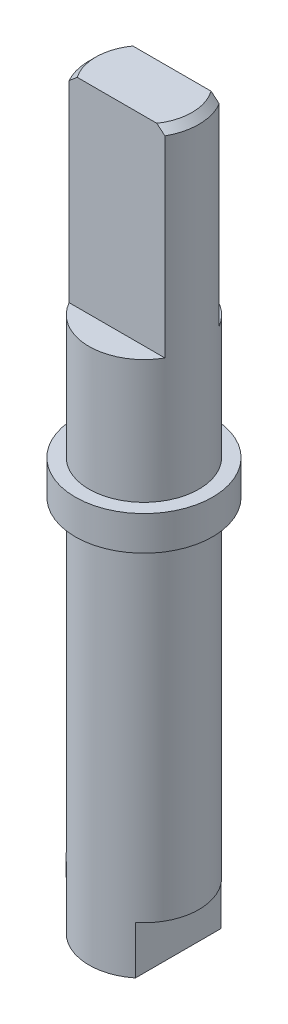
ISO-10303-21;
HEADER;
FILE_DESCRIPTION(('STEP AP214'),'2;1');
FILE_NAME('part.step','',(''),(''),'','','');
FILE_SCHEMA(('AUTOMOTIVE_DESIGN { 1 0 10303 214 1 1 1 1 }'));
ENDSEC;
DATA;
#1=APPLICATION_CONTEXT('core data for automotive mechanical design processes');
#2=APPLICATION_PROTOCOL_DEFINITION('international standard','automotive_design',2000,#1);
#3=PRODUCT_CONTEXT('',#1,'mechanical');
#4=PRODUCT('Part','Part','',(#3));
#5=PRODUCT_RELATED_PRODUCT_CATEGORY('part','',(#4));
#6=PRODUCT_DEFINITION_FORMATION('','',#4);
#7=PRODUCT_DEFINITION_CONTEXT('part definition',#1,'design');
#8=PRODUCT_DEFINITION('design','',#6,#7);
#9=PRODUCT_DEFINITION_SHAPE('','',#8);
#10=(LENGTH_UNIT() NAMED_UNIT(*) SI_UNIT(.MILLI.,.METRE.));
#11=(NAMED_UNIT(*) PLANE_ANGLE_UNIT() SI_UNIT($,.RADIAN.));
#12=(NAMED_UNIT(*) SI_UNIT($,.STERADIAN.) SOLID_ANGLE_UNIT());
#13=UNCERTAINTY_MEASURE_WITH_UNIT(LENGTH_MEASURE(1.E-05),#10,'distance_accuracy_value','');
#14=(GEOMETRIC_REPRESENTATION_CONTEXT(3) GLOBAL_UNCERTAINTY_ASSIGNED_CONTEXT((#13)) GLOBAL_UNIT_ASSIGNED_CONTEXT((#10,
#11,#12)) REPRESENTATION_CONTEXT('',''));
#15=CARTESIAN_POINT('',(0.,0.,0.));
#16=DIRECTION('',(0.,0.,1.));
#17=DIRECTION('',(1.,0.,0.));
#18=AXIS2_PLACEMENT_3D('',#15,#16,#17);
#19=CARTESIAN_POINT('',(0.,-53.5,0.));
#20=DIRECTION('',(0.,1.,0.));
#21=DIRECTION('',(0.,0.,1.));
#22=AXIS2_PLACEMENT_3D('',#19,#20,#21);
#23=PLANE('',#22);
#24=DIRECTION('',(0.,0.,-1.));
#25=VECTOR('',#24,1.);
#26=CARTESIAN_POINT('',(-5.,-53.5,14.4051103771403));
#27=LINE('',#26,#25);
#28=CARTESIAN_POINT('',(-5.,-53.5,6.2449979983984));
#29=VERTEX_POINT('',#28);
#30=CARTESIAN_POINT('',(-5.,-53.5,-6.2449979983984));
#31=VERTEX_POINT('',#30);
#32=EDGE_CURVE('E63',#29,#31,#27,.T.);
#33=ORIENTED_EDGE('',*,*,#32,.T.);
#34=CARTESIAN_POINT('',(0.,-53.5,0.));
#35=DIRECTION('',(0.,1.,0.));
#36=DIRECTION('',(0.,0.,1.));
#37=AXIS2_PLACEMENT_3D('',#34,#35,#36);
#38=CIRCLE('',#37,8.);
#39=CARTESIAN_POINT('',(5.,-53.5,-6.2449979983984));
#40=VERTEX_POINT('',#39);
#41=EDGE_CURVE('E139',#40,#31,#38,.T.);
#42=ORIENTED_EDGE('',*,*,#41,.F.);
#43=DIRECTION('',(0.,0.,1.));
#44=VECTOR('',#43,1.);
#45=CARTESIAN_POINT('',(5.,-53.5,14.4051103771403));
#46=LINE('',#45,#44);
#47=CARTESIAN_POINT('',(5.,-53.5,6.2449979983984));
#48=VERTEX_POINT('',#47);
#49=EDGE_CURVE('E71',#40,#48,#46,.T.);
#50=ORIENTED_EDGE('',*,*,#49,.T.);
#51=EDGE_CURVE('E137',#29,#48,#38,.T.);
#52=ORIENTED_EDGE('',*,*,#51,.F.);
#53=EDGE_LOOP('',(#33,#42,#50,#52));
#54=FACE_BOUND('',#53,.T.);
#55=ADVANCED_FACE('F48',(#54),#23,.F.);
#56=CARTESIAN_POINT('',(0.,53.5,0.));
#57=DIRECTION('',(0.,-1.,0.));
#58=DIRECTION('',(0.,0.,-1.));
#59=AXIS2_PLACEMENT_3D('',#56,#57,#58);
#60=CYLINDRICAL_SURFACE('',#59,8.);
#61=CARTESIAN_POINT('',(0.,1.5,0.));
#62=DIRECTION('',(0.,1.,0.));
#63=DIRECTION('',(0.,0.,1.));
#64=AXIS2_PLACEMENT_3D('',#61,#62,#63);
#65=CIRCLE('',#64,8.);
#66=CARTESIAN_POINT('',(0.,1.5,8.));
#67=VERTEX_POINT('',#66);
#68=EDGE_CURVE('E161',#67,#67,#65,.T.);
#69=ORIENTED_EDGE('',*,*,#68,.F.);
#70=EDGE_LOOP('',(#69));
#71=FACE_BOUND('',#70,.T.);
#72=DIRECTION('',(0.,-1.,0.));
#73=VECTOR('',#72,1.);
#74=CARTESIAN_POINT('',(-5.,53.5,-6.2449979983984));
#75=LINE('',#74,#73);
#76=CARTESIAN_POINT('',(-5.,-46.5,-6.2449979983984));
#77=VERTEX_POINT('',#76);
#78=EDGE_CURVE('E14',#77,#31,#75,.T.);
#79=ORIENTED_EDGE('',*,*,#78,.F.);
#80=CARTESIAN_POINT('',(0.,-46.5,0.));
#81=DIRECTION('',(0.,-1.,0.));
#82=DIRECTION('',(0.,0.,-1.));
#83=AXIS2_PLACEMENT_3D('',#80,#81,#82);
#84=CIRCLE('',#83,8.);
#85=CARTESIAN_POINT('',(-5.,-46.5,6.2449979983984));
#86=VERTEX_POINT('',#85);
#87=EDGE_CURVE('E57',#86,#77,#84,.T.);
#88=ORIENTED_EDGE('',*,*,#87,.F.);
#89=DIRECTION('',(0.,-1.,0.));
#90=VECTOR('',#89,1.);
#91=CARTESIAN_POINT('',(-5.,53.5,6.2449979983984));
#92=LINE('',#91,#90);
#93=EDGE_CURVE('E131',#29,#86,#92,.F.);
#94=ORIENTED_EDGE('',*,*,#93,.F.);
#95=ORIENTED_EDGE('',*,*,#51,.T.);
#96=DIRECTION('',(0.,-1.,0.));
#97=VECTOR('',#96,1.);
#98=CARTESIAN_POINT('',(5.,53.5,6.2449979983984));
#99=LINE('',#98,#97);
#100=CARTESIAN_POINT('',(5.,-46.5,6.2449979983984));
#101=VERTEX_POINT('',#100);
#102=EDGE_CURVE('E124',#101,#48,#99,.T.);
#103=ORIENTED_EDGE('',*,*,#102,.F.);
#104=CARTESIAN_POINT('',(5.,-46.5,-6.2449979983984));
#105=VERTEX_POINT('',#104);
#106=EDGE_CURVE('E132',#105,#101,#84,.T.);
#107=ORIENTED_EDGE('',*,*,#106,.F.);
#108=DIRECTION('',(0.,-1.,0.));
#109=VECTOR('',#108,1.);
#110=CARTESIAN_POINT('',(5.,53.5,-6.2449979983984));
#111=LINE('',#110,#109);
#112=EDGE_CURVE('E277',#40,#105,#111,.F.);
#113=ORIENTED_EDGE('',*,*,#112,.F.);
#114=ORIENTED_EDGE('',*,*,#41,.T.);
#115=EDGE_LOOP('',(#79,#88,#94,#95,#103,#107,#113,#114));
#116=FACE_BOUND('',#115,.T.);
#117=ADVANCED_FACE('F143',(#71,#116),#60,.T.);
#118=CARTESIAN_POINT('',(0.,6.5,0.));
#119=DIRECTION('',(0.,1.,0.));
#120=DIRECTION('',(0.,0.,1.));
#121=AXIS2_PLACEMENT_3D('',#118,#119,#120);
#122=CIRCLE('',#121,8.);
#123=CARTESIAN_POINT('',(0.,6.5,8.));
#124=VERTEX_POINT('',#123);
#125=EDGE_CURVE('E145',#124,#124,#122,.T.);
#126=ORIENTED_EDGE('',*,*,#125,.T.);
#127=EDGE_LOOP('',(#126));
#128=FACE_BOUND('',#127,.T.);
#129=DIRECTION('',(0.,-1.,0.));
#130=VECTOR('',#129,1.);
#131=CARTESIAN_POINT('',(6.88329001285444,53.5,-4.07680249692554));
#132=LINE('',#131,#130);
#133=CARTESIAN_POINT('',(6.88329001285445,52.5,-4.07680249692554));
#134=VERTEX_POINT('',#133);
#135=CARTESIAN_POINT('',(6.88329001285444,24.5,-4.07680249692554));
#136=VERTEX_POINT('',#135);
#137=EDGE_CURVE('E222',#134,#136,#132,.T.);
#138=ORIENTED_EDGE('',*,*,#137,.F.);
#139=CARTESIAN_POINT('',(0.,52.5,0.));
#140=DIRECTION('',(0.,1.,0.));
#141=DIRECTION('',(0.,0.,1.));
#142=AXIS2_PLACEMENT_3D('',#139,#140,#141);
#143=CIRCLE('',#142,8.);
#144=CARTESIAN_POINT('',(6.97198116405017,52.5,3.92319750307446));
#145=VERTEX_POINT('',#144);
#146=EDGE_CURVE('E158',#134,#145,#143,.F.);
#147=ORIENTED_EDGE('',*,*,#146,.T.);
#148=DIRECTION('',(0.,-1.,0.));
#149=VECTOR('',#148,1.);
#150=CARTESIAN_POINT('',(6.97198116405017,53.5,3.92319750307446));
#151=LINE('',#150,#149);
#152=CARTESIAN_POINT('',(6.97198116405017,24.5,3.92319750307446));
#153=VERTEX_POINT('',#152);
#154=EDGE_CURVE('E240',#153,#145,#151,.F.);
#155=ORIENTED_EDGE('',*,*,#154,.F.);
#156=CARTESIAN_POINT('',(0.,24.5,0.));
#157=DIRECTION('',(0.,1.,0.));
#158=DIRECTION('',(0.,0.,1.));
#159=AXIS2_PLACEMENT_3D('',#156,#157,#158);
#160=CIRCLE('',#159,8.);
#161=CARTESIAN_POINT('',(-6.97198116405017,24.5,3.92319750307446));
#162=VERTEX_POINT('',#161);
#163=EDGE_CURVE('E268',#162,#153,#160,.T.);
#164=ORIENTED_EDGE('',*,*,#163,.F.);
#165=DIRECTION('',(0.,-1.,0.));
#166=VECTOR('',#165,1.);
#167=CARTESIAN_POINT('',(-6.97198116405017,53.5,3.92319750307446));
#168=LINE('',#167,#166);
#169=CARTESIAN_POINT('',(-6.97198116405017,52.5,3.92319750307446));
#170=VERTEX_POINT('',#169);
#171=EDGE_CURVE('E254',#170,#162,#168,.T.);
#172=ORIENTED_EDGE('',*,*,#171,.F.);
#173=CARTESIAN_POINT('',(-6.88329001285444,52.5,-4.07680249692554));
#174=VERTEX_POINT('',#173);
#175=EDGE_CURVE('E159',#170,#174,#143,.F.);
#176=ORIENTED_EDGE('',*,*,#175,.T.);
#177=DIRECTION('',(0.,-1.,0.));
#178=VECTOR('',#177,1.);
#179=CARTESIAN_POINT('',(-6.88329001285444,53.5,-4.07680249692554));
#180=LINE('',#179,#178);
#181=CARTESIAN_POINT('',(-6.88329001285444,24.5,-4.07680249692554));
#182=VERTEX_POINT('',#181);
#183=EDGE_CURVE('E230',#182,#174,#180,.F.);
#184=ORIENTED_EDGE('',*,*,#183,.F.);
#185=EDGE_CURVE('E226',#136,#182,#160,.T.);
#186=ORIENTED_EDGE('',*,*,#185,.F.);
#187=EDGE_LOOP('',(#138,#147,#155,#164,#172,#176,#184,#186));
#188=FACE_BOUND('',#187,.T.);
#189=ADVANCED_FACE('F208',(#128,#188),#60,.T.);
#190=CARTESIAN_POINT('',(0.,53.5,0.));
#191=DIRECTION('',(0.,1.,0.));
#192=DIRECTION('',(0.,0.,1.));
#193=AXIS2_PLACEMENT_3D('',#190,#191,#192);
#194=PLANE('',#193);
#195=CARTESIAN_POINT('',(0.,53.5,0.));
#196=DIRECTION('',(0.,1.,0.));
#197=DIRECTION('',(0.,0.,1.));
#198=AXIS2_PLACEMENT_3D('',#195,#196,#197);
#199=CIRCLE('',#198,7.00000000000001);
#200=CARTESIAN_POINT('',(5.79728568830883,53.5,3.92319750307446));
#201=VERTEX_POINT('',#200);
#202=CARTESIAN_POINT('',(5.69031470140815,53.5,-4.07680249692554));
#203=VERTEX_POINT('',#202);
#204=EDGE_CURVE('E155',#201,#203,#199,.T.);
#205=ORIENTED_EDGE('',*,*,#204,.T.);
#206=DIRECTION('',(-1.,0.,0.));
#207=VECTOR('',#206,1.);
#208=CARTESIAN_POINT('',(-10.4524178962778,53.5,-4.07680249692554));
#209=LINE('',#208,#207);
#210=CARTESIAN_POINT('',(-5.69031470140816,53.5,-4.07680249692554));
#211=VERTEX_POINT('',#210);
#212=EDGE_CURVE('E244',#203,#211,#209,.T.);
#213=ORIENTED_EDGE('',*,*,#212,.T.);
#214=CARTESIAN_POINT('',(-5.79728568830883,53.5,3.92319750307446));
#215=VERTEX_POINT('',#214);
#216=EDGE_CURVE('E147',#211,#215,#199,.T.);
#217=ORIENTED_EDGE('',*,*,#216,.T.);
#218=DIRECTION('',(1.,0.,0.));
#219=VECTOR('',#218,1.);
#220=CARTESIAN_POINT('',(-10.4524178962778,53.5,3.92319750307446));
#221=LINE('',#220,#219);
#222=EDGE_CURVE('E237',#215,#201,#221,.T.);
#223=ORIENTED_EDGE('',*,*,#222,.T.);
#224=EDGE_LOOP('',(#205,#213,#217,#223));
#225=FACE_BOUND('',#224,.T.);
#226=ADVANCED_FACE('F205',(#225),#194,.T.);
#227=CARTESIAN_POINT('',(0.,53.5,0.));
#228=DIRECTION('',(0.,-1.,0.));
#229=DIRECTION('',(0.,0.,-1.));
#230=AXIS2_PLACEMENT_3D('',#227,#228,#229);
#231=CONICAL_SURFACE('',#230,7.00000000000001,0.785398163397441);
#232=ORIENTED_EDGE('',*,*,#146,.F.);
#233=CARTESIAN_POINT('',(17.1407828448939,42.8810682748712,-4.07680249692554));
#234=CARTESIAN_POINT('',(16.7081649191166,43.3019166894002,-4.07680249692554));
#235=CARTESIAN_POINT('',(16.2751474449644,43.7223559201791,-4.07680249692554));
#236=CARTESIAN_POINT('',(15.4080238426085,44.5621337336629,-4.07680249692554));
#237=CARTESIAN_POINT('',(14.9739176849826,44.9814722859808,-4.07680249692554));
#238=CARTESIAN_POINT('',(14.1036359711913,45.8194316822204,-4.07680249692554));
#239=CARTESIAN_POINT('',(13.6674581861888,46.238050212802,-4.07680249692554));
#240=CARTESIAN_POINT('',(12.7933325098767,47.073419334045,-4.07680249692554));
#241=CARTESIAN_POINT('',(12.3553846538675,47.4901699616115,-4.07680249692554));
#242=CARTESIAN_POINT('',(11.4477839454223,48.3489076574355,-4.07680249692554));
#243=CARTESIAN_POINT('',(10.9779669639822,48.7907214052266,-4.07680249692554));
#244=CARTESIAN_POINT('',(10.034500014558,49.6703113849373,-4.07680249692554));
#245=CARTESIAN_POINT('',(9.56084980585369,50.1080873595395,-4.07680249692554));
#246=CARTESIAN_POINT('',(8.8463945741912,50.7598950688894,-4.07680249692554));
#247=CARTESIAN_POINT('',(8.6077043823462,50.9762439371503,-4.07680249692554));
#248=CARTESIAN_POINT('',(8.12856811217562,51.4069869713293,-4.07680249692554));
#249=CARTESIAN_POINT('',(7.88812205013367,51.6213811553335,-4.07680249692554));
#250=CARTESIAN_POINT('',(7.40505100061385,52.0476518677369,-4.07680249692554));
#251=CARTESIAN_POINT('',(7.16242624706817,52.2595286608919,-4.07680249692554));
#252=CARTESIAN_POINT('',(6.67436856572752,52.6800178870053,-4.07680249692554));
#253=CARTESIAN_POINT('',(6.42893573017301,52.8886304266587,-4.07680249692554));
#254=CARTESIAN_POINT('',(6.02063791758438,53.2294722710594,-4.07680249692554));
#255=CARTESIAN_POINT('',(5.85882964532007,53.3629665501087,-4.07680249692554));
#256=CARTESIAN_POINT('',(5.53333321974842,53.6276562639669,-4.07680249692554));
#257=CARTESIAN_POINT('',(5.36964502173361,53.7588516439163,-4.07680249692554));
#258=CARTESIAN_POINT('',(5.03975753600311,54.0185564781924,-4.07680249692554));
#259=CARTESIAN_POINT('',(4.87355492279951,54.1470617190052,-4.07680249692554));
#260=CARTESIAN_POINT('',(4.53837617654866,54.400399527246,-4.07680249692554));
#261=CARTESIAN_POINT('',(4.36940017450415,54.5252322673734,-4.07680249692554));
#262=CARTESIAN_POINT('',(4.02960494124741,54.7690187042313,-4.07680249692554));
#263=CARTESIAN_POINT('',(3.8588171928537,54.8880160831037,-4.07680249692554));
#264=CARTESIAN_POINT('',(3.51305669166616,55.1199049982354,-4.07680249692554));
#265=CARTESIAN_POINT('',(3.33808293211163,55.2327950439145,-4.07680249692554));
#266=CARTESIAN_POINT('',(2.98343254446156,55.4500913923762,-4.07680249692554));
#267=CARTESIAN_POINT('',(2.80376711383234,55.5545158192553,-4.07680249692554));
#268=CARTESIAN_POINT('',(2.43839913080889,55.7521059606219,-4.07680249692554));
#269=CARTESIAN_POINT('',(2.2527006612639,55.8452790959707,-4.07680249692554));
#270=CARTESIAN_POINT('',(1.91349129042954,55.9984561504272,-4.07680249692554));
#271=CARTESIAN_POINT('',(1.76128989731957,56.0613318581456,-4.07680249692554));
#272=CARTESIAN_POINT('',(1.45224219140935,56.1746472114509,-4.07680249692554));
#273=CARTESIAN_POINT('',(1.29539585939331,56.2250868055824,-4.07680249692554));
#274=CARTESIAN_POINT('',(0.97891552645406,56.3100585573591,-4.07680249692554));
#275=CARTESIAN_POINT('',(0.81932049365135,56.3447329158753,-4.07680249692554));
#276=CARTESIAN_POINT('',(0.497249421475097,56.3960521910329,-4.07680249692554));
#277=CARTESIAN_POINT('',(0.33477491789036,56.4127064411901,-4.07680249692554));
#278=CARTESIAN_POINT('',(0.0394180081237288,56.4251618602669,-4.07680249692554));
#279=CARTESIAN_POINT('',(-0.0933311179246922,56.4242733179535,-4.07680249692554));
#280=CARTESIAN_POINT('',(-0.358105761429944,56.4096340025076,-4.07680249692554));
#281=CARTESIAN_POINT('',(-0.490131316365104,56.3958839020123,-4.07680249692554));
#282=CARTESIAN_POINT('',(-0.752997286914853,56.3562895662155,-4.07680249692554));
#283=CARTESIAN_POINT('',(-0.883828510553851,56.3303853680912,-4.07680249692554));
#284=CARTESIAN_POINT('',(-1.14289725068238,56.2678950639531,-4.07680249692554));
#285=CARTESIAN_POINT('',(-1.27113419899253,56.2313066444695,-4.07680249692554));
#286=CARTESIAN_POINT('',(-1.60252892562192,56.1238241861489,-4.07680249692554));
#287=CARTESIAN_POINT('',(-1.80332119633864,56.0456630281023,-4.07680249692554));
#288=CARTESIAN_POINT('',(-2.19731763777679,55.8721354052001,-4.07680249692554));
#289=CARTESIAN_POINT('',(-2.39051472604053,55.7767533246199,-4.07680249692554));
#290=CARTESIAN_POINT('',(-2.67565812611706,55.6242409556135,-4.07680249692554));
#291=CARTESIAN_POINT('',(-2.770117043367,55.5717143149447,-4.07680249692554));
#292=CARTESIAN_POINT('',(-2.95750969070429,55.4640003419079,-4.07680249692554));
#293=CARTESIAN_POINT('',(-3.0504434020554,55.4088129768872,-4.07680249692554));
#294=CARTESIAN_POINT('',(-3.23488056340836,55.2962090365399,-4.07680249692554));
#295=CARTESIAN_POINT('',(-3.32638471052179,55.2387935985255,-4.07680249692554));
#296=CARTESIAN_POINT('',(-3.50814381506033,55.1220309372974,-4.07680249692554));
#297=CARTESIAN_POINT('',(-3.5983988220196,55.0626837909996,-4.07680249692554));
#298=CARTESIAN_POINT('',(-3.90245718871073,54.8587126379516,-4.07680249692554));
#299=CARTESIAN_POINT('',(-4.11365066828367,54.7101936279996,-4.07680249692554));
#300=CARTESIAN_POINT('',(-4.53117345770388,54.4064457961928,-4.07680249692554));
#301=CARTESIAN_POINT('',(-4.73750169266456,54.2512155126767,-4.07680249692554));
#302=CARTESIAN_POINT('',(-5.14649613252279,53.9357174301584,-4.07680249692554));
#303=CARTESIAN_POINT('',(-5.34915958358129,53.7754460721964,-4.07680249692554));
#304=CARTESIAN_POINT('',(-5.75146645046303,53.4512038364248,-4.07680249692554));
#305=CARTESIAN_POINT('',(-5.951110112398,53.2872332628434,-4.07680249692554));
#306=CARTESIAN_POINT('',(-6.34845573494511,52.9560532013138,-4.07680249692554));
#307=CARTESIAN_POINT('',(-6.54615226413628,52.788837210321,-4.07680249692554));
#308=CARTESIAN_POINT('',(-6.93960533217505,52.4521357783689,-4.07680249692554));
#309=CARTESIAN_POINT('',(-7.13536183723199,52.2826502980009,-4.07680249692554));
#310=CARTESIAN_POINT('',(-7.72011115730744,51.771637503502,-4.07680249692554));
#311=CARTESIAN_POINT('',(-8.10674794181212,51.4274156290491,-4.07680249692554));
#312=CARTESIAN_POINT('',(-8.87615301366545,50.7337893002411,-4.07680249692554));
#313=CARTESIAN_POINT('',(-9.25891618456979,50.3843791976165,-4.07680249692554));
#314=CARTESIAN_POINT('',(-10.0213619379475,49.6821452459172,-4.07680249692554));
#315=CARTESIAN_POINT('',(-10.4010442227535,49.3293210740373,-4.07680249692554));
#316=CARTESIAN_POINT('',(-11.1576532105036,48.6216288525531,-4.07680249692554));
#317=CARTESIAN_POINT('',(-11.5345826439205,48.2667637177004,-4.07680249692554));
#318=CARTESIAN_POINT('',(-12.2866913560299,47.5551829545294,-4.07680249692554));
#319=CARTESIAN_POINT('',(-12.6618706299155,47.1984673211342,-4.07680249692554));
#320=CARTESIAN_POINT('',(-13.3806755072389,46.5124249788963,-4.07680249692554));
#321=CARTESIAN_POINT('',(-13.724406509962,46.1832086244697,-4.07680249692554));
#322=CARTESIAN_POINT('',(-14.411029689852,45.5237197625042,-4.07680249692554));
#323=CARTESIAN_POINT('',(-14.7539216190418,45.1934469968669,-4.07680249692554));
#324=CARTESIAN_POINT('',(-15.4378774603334,44.5331456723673,-4.07680249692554));
#325=CARTESIAN_POINT('',(-15.7789437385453,44.2031195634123,-4.07680249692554));
#326=CARTESIAN_POINT('',(-16.4603521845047,43.5425051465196,-4.07680249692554));
#327=CARTESIAN_POINT('',(-16.8006945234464,43.2119170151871,-4.07680249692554));
#328=CARTESIAN_POINT('',(-17.1407828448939,42.8810682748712,-4.07680249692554));
#329=B_SPLINE_CURVE_WITH_KNOTS('',3,(#233,#234,#235,#236,#237,#238,#239,#240,#241,#242,#243,
#244,#245,#246,#247,#248,#249,#250,#251,#252,#253,#254,#255,#256,#257,#258,#259,#260,#261,#262,
#263,#264,#265,#266,#267,#268,#269,#270,#271,#272,#273,#274,#275,#276,#277,#278,#279,#280,#281,
#282,#283,#284,#285,#286,#287,#288,#289,#290,#291,#292,#293,#294,#295,#296,#297,#298,#299,#300,
#301,#302,#303,#304,#305,#306,#307,#308,#309,#310,#311,#312,#313,#314,#315,#316,#317,#318,#319,
#320,#321,#322,#323,#324,#325,#326,#327,#328),.UNSPECIFIED.,.F.,.F.,(4,2,2,2,2,2,2,2,2,2,2,2,2,
2,2,2,2,2,2,2,2,2,2,2,2,2,2,2,2,2,2,2,2,2,2,2,2,2,2,2,2,2,2,2,2,2,2,4),(0.,1.81064900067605,
3.62134747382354,5.43502279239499,7.24866211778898,9.18342116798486,11.1183026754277,
12.0847410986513,13.0511705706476,14.0174974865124,14.9837927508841,15.6130806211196,
16.2423834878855,16.8726076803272,17.5028021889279,18.127170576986,18.7516906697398,
19.3748363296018,19.9975687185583,20.4911820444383,20.9847974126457,21.4738675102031,
21.9626841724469,22.3603211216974,22.7579372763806,23.1575360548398,23.557221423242,
24.2024204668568,24.8482075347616,25.1724165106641,25.4966294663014,25.820679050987,
26.1447157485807,26.919062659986,27.6935790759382,28.4686551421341,29.2436676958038,
30.0204381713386,30.7972221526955,32.3501464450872,33.9049074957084,35.4598170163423,
37.0128854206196,38.5659580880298,39.9938248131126,41.4220720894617,42.8458657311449,
44.2692735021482),.UNSPECIFIED.);
#330=EDGE_CURVE('E235',#134,#203,#329,.T.);
#331=ORIENTED_EDGE('',*,*,#330,.T.);
#332=ORIENTED_EDGE('',*,*,#204,.F.);
#333=CARTESIAN_POINT('',(-17.1765909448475,42.8810682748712,3.92319750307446));
#334=CARTESIAN_POINT('',(-16.7101786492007,43.3357339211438,3.92319750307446));
#335=CARTESIAN_POINT('',(-16.2433417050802,43.7899656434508,3.92319750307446));
#336=CARTESIAN_POINT('',(-15.3084626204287,44.697232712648,3.92319750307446));
#337=CARTESIAN_POINT('',(-14.8404204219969,45.1502679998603,3.92319750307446));
#338=CARTESIAN_POINT('',(-13.9018426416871,46.0557124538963,3.92319750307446));
#339=CARTESIAN_POINT('',(-13.4313038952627,46.508118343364,3.92319750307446));
#340=CARTESIAN_POINT('',(-12.4881968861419,47.4107731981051,3.92319750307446));
#341=CARTESIAN_POINT('',(-12.0156287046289,47.8610222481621,3.92319750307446));
#342=CARTESIAN_POINT('',(-11.042194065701,48.7826846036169,3.92319750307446));
#343=CARTESIAN_POINT('',(-10.5411722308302,49.253934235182,3.92319750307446));
#344=CARTESIAN_POINT('',(-9.78615454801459,49.9571346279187,3.92319750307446));
#345=CARTESIAN_POINT('',(-9.53388439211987,50.1909377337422,3.92319750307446));
#346=CARTESIAN_POINT('',(-9.02791078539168,50.656986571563,3.92319750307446));
#347=CARTESIAN_POINT('',(-8.77420734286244,50.8892323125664,3.92319750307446));
#348=CARTESIAN_POINT('',(-8.26528227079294,51.3515000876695,3.92319750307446));
#349=CARTESIAN_POINT('',(-8.01006258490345,51.5815242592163,3.92319750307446));
#350=CARTESIAN_POINT('',(-7.49734410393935,52.0390172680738,3.92319750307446));
#351=CARTESIAN_POINT('',(-7.2398453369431,52.2664861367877,3.92319750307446));
#352=CARTESIAN_POINT('',(-6.72193639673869,52.7179819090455,3.92319750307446));
#353=CARTESIAN_POINT('',(-6.46152683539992,52.9420095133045,3.92319750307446));
#354=CARTESIAN_POINT('',(-5.93679265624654,53.385422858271,3.92319750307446));
#355=CARTESIAN_POINT('',(-5.67246831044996,53.6048089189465,3.92319750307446));
#356=CARTESIAN_POINT('',(-5.28625364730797,53.9173634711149,3.92319750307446));
#357=CARTESIAN_POINT('',(-5.16650643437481,54.013180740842,3.92319750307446));
#358=CARTESIAN_POINT('',(-4.92576446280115,54.2032420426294,3.92319750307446));
#359=CARTESIAN_POINT('',(-4.80476968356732,54.2974860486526,3.92319750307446));
#360=CARTESIAN_POINT('',(-4.56127085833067,54.4841413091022,3.92319750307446));
#361=CARTESIAN_POINT('',(-4.4387660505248,54.5765515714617,3.92319750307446));
#362=CARTESIAN_POINT('',(-4.19206778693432,54.7590921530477,3.92319750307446));
#363=CARTESIAN_POINT('',(-4.06787435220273,54.8492225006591,3.92319750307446));
#364=CARTESIAN_POINT('',(-3.81807377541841,55.0262958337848,3.92319750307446));
#365=CARTESIAN_POINT('',(-3.69247557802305,55.1132514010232,3.92319750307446));
#366=CARTESIAN_POINT('',(-3.438984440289,55.2837472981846,3.92319750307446));
#367=CARTESIAN_POINT('',(-3.31109164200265,55.3672878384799,3.92319750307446));
#368=CARTESIAN_POINT('',(-3.0527045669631,55.5300483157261,3.92319750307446));
#369=CARTESIAN_POINT('',(-2.92221227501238,55.6092713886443,3.92319750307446));
#370=CARTESIAN_POINT('',(-2.65811689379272,55.7623337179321,3.92319750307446));
#371=CARTESIAN_POINT('',(-2.52451438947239,55.836173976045,3.92319750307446));
#372=CARTESIAN_POINT('',(-2.26633460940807,55.970457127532,3.92319750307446));
#373=CARTESIAN_POINT('',(-2.14207519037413,56.0315072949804,3.92319750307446));
#374=CARTESIAN_POINT('',(-1.89030570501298,56.1465875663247,3.92319750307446));
#375=CARTESIAN_POINT('',(-1.76279543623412,56.2006172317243,3.92319750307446));
#376=CARTESIAN_POINT('',(-1.50467482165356,56.2998371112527,3.92319750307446));
#377=CARTESIAN_POINT('',(-1.37407216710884,56.3450471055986,3.92319750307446));
#378=CARTESIAN_POINT('',(-1.10967029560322,56.4248319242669,3.92319750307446));
#379=CARTESIAN_POINT('',(-0.975872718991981,56.4594120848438,3.92319750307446));
#380=CARTESIAN_POINT('',(-0.727855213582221,56.511383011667,3.92319750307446));
#381=CARTESIAN_POINT('',(-0.614033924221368,56.5306653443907,3.92319750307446));
#382=CARTESIAN_POINT('',(-0.385169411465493,56.5595734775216,3.92319750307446));
#383=CARTESIAN_POINT('',(-0.270126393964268,56.5692008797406,3.92319750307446));
#384=CARTESIAN_POINT('',(-0.0398371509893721,56.5782841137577,3.92319750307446));
#385=CARTESIAN_POINT('',(0.0754083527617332,56.577757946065,3.92319750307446));
#386=CARTESIAN_POINT('',(0.305414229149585,56.5666109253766,3.92319750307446));
#387=CARTESIAN_POINT('',(0.42017452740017,56.5559885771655,3.92319750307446));
#388=CARTESIAN_POINT('',(0.67597984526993,56.5214657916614,3.92319750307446));
#389=CARTESIAN_POINT('',(0.816676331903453,56.4949773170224,3.92319750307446));
#390=CARTESIAN_POINT('',(1.09500069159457,56.4291064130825,3.92319750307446));
#391=CARTESIAN_POINT('',(1.23262732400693,56.3897188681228,3.92319750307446));
#392=CARTESIAN_POINT('',(1.5051231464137,56.2999747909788,3.92319750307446));
#393=CARTESIAN_POINT('',(1.6399710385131,56.249554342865,3.92319750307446));
#394=CARTESIAN_POINT('',(1.83947960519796,56.1673917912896,3.92319750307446));
#395=CARTESIAN_POINT('',(1.90551759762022,56.1389177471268,3.92319750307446));
#396=CARTESIAN_POINT('',(2.0367150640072,56.0800166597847,3.92319750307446));
#397=CARTESIAN_POINT('',(2.10187457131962,56.0495896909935,3.92319750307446));
#398=CARTESIAN_POINT('',(2.29832508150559,55.9546214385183,3.92319750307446));
#399=CARTESIAN_POINT('',(2.42829947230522,55.8873501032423,3.92319750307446));
#400=CARTESIAN_POINT('',(2.68515430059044,55.7471107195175,3.92319750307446));
#401=CARTESIAN_POINT('',(2.81203378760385,55.6741409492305,3.92319750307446));
#402=CARTESIAN_POINT('',(3.06319937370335,55.5236001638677,3.92319750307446));
#403=CARTESIAN_POINT('',(3.18748265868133,55.4460244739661,3.92319750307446));
#404=CARTESIAN_POINT('',(3.43370738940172,55.2872295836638,3.92319750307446));
#405=CARTESIAN_POINT('',(3.5556485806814,55.2060099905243,3.92319750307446));
#406=CARTESIAN_POINT('',(3.7979911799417,55.0402961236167,3.92319750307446));
#407=CARTESIAN_POINT('',(3.91838453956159,54.9557901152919,3.92319750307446));
#408=CARTESIAN_POINT('',(4.15742660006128,54.7843413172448,3.92319750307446));
#409=CARTESIAN_POINT('',(4.27607521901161,54.6973984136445,3.92319750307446));
#410=CARTESIAN_POINT('',(4.62963280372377,54.4336803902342,3.92319750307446));
#411=CARTESIAN_POINT('',(4.86230679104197,54.2539095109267,3.92319750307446));
#412=CARTESIAN_POINT('',(5.32631896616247,53.8863079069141,3.92319750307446));
#413=CARTESIAN_POINT('',(5.55759627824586,53.698400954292,3.92319750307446));
#414=CARTESIAN_POINT('',(6.01670754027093,53.3183796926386,3.92319750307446));
#415=CARTESIAN_POINT('',(6.24454105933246,53.1262648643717,3.92319750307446));
#416=CARTESIAN_POINT('',(6.69694548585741,52.7394036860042,3.92319750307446));
#417=CARTESIAN_POINT('',(6.92152325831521,52.5446653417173,3.92319750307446));
#418=CARTESIAN_POINT('',(7.3685792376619,52.1527905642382,3.92319750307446));
#419=CARTESIAN_POINT('',(7.59105741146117,51.9556540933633,3.92319750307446));
#420=CARTESIAN_POINT('',(8.22246741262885,51.3914094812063,3.92319750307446));
#421=CARTESIAN_POINT('',(8.62938514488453,51.0220491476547,3.92319750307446));
#422=CARTESIAN_POINT('',(9.43934572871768,50.2790942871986,3.92319750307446));
#423=CARTESIAN_POINT('',(9.84238845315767,49.9054996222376,3.92319750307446));
#424=CARTESIAN_POINT('',(10.646101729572,49.1549437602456,3.92319750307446));
#425=CARTESIAN_POINT('',(11.0467694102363,48.7779794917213,3.92319750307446));
#426=CARTESIAN_POINT('',(11.8460473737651,48.0218763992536,3.92319750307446));
#427=CARTESIAN_POINT('',(12.2446576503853,47.6427375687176,3.92319750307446));
#428=CARTESIAN_POINT('',(13.0226985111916,46.8996515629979,3.92319750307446));
#429=CARTESIAN_POINT('',(13.4021967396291,46.5357751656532,3.92319750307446));
#430=CARTESIAN_POINT('',(14.1600749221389,45.8068569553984,3.92319750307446));
#431=CARTESIAN_POINT('',(14.5384548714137,45.4418151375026,3.92319750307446));
#432=CARTESIAN_POINT('',(15.2938736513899,44.711244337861,3.92319750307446));
#433=CARTESIAN_POINT('',(15.670913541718,44.3457164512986,3.92319750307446));
#434=CARTESIAN_POINT('',(16.4242608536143,43.6139122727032,3.92319750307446));
#435=CARTESIAN_POINT('',(16.8005682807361,43.2476359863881,3.92319750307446));
#436=CARTESIAN_POINT('',(17.1765909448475,42.8810682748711,3.92319750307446));
#437=B_SPLINE_CURVE_WITH_KNOTS('',3,(#333,#334,#335,#336,#337,#338,#339,#340,#341,#342,#343,
#344,#345,#346,#347,#348,#349,#350,#351,#352,#353,#354,#355,#356,#357,#358,#359,#360,#361,#362,
#363,#364,#365,#366,#367,#368,#369,#370,#371,#372,#373,#374,#375,#376,#377,#378,#379,#380,#381,
#382,#383,#384,#385,#386,#387,#388,#389,#390,#391,#392,#393,#394,#395,#396,#397,#398,#399,#400,
#401,#402,#403,#404,#405,#406,#407,#408,#409,#410,#411,#412,#413,#414,#415,#416,#417,#418,#419,
#420,#421,#422,#423,#424,#425,#426,#427,#428,#429,#430,#431,#432,#433,#434,#435,#436),
.UNSPECIFIED.,.F.,.F.,(4,2,2,2,2,2,2,2,2,2,2,2,2,2,2,2,2,2,2,2,2,2,2,2,2,2,2,2,2,2,2,2,2,2,2,2,
2,2,2,2,2,2,2,2,2,2,2,2,2,2,2,4),(0.,1.95406171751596,3.90821912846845,5.86645285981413,
7.82460897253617,9.88804867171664,10.9199048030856,11.951754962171,12.9824866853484,
14.0132057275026,15.0437120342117,16.0741470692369,16.534227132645,16.9943148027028,
17.454644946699,17.9149693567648,18.3732099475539,18.8314222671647,19.2892972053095,
19.7470867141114,20.1622533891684,20.5774459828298,20.9916964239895,21.4057385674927,
21.7516950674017,22.0975941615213,22.4428800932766,22.7882171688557,23.2169912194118,
23.6459355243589,24.0774338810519,24.2931542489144,24.5088664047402,24.947722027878,
25.3867107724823,25.8261529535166,26.2656426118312,26.7068794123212,27.1481368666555,
28.0300922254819,28.9240045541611,29.8180278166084,30.7097598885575,31.6015059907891,
33.2501149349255,34.8987777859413,36.5491389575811,38.1995051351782,39.7767859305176,
41.3540734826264,42.9294857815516,44.5048860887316),.UNSPECIFIED.);
#438=EDGE_CURVE('E165',#201,#145,#437,.T.);
#439=ORIENTED_EDGE('',*,*,#438,.T.);
#440=EDGE_LOOP('',(#232,#331,#332,#439));
#441=FACE_BOUND('',#440,.T.);
#442=ADVANCED_FACE('F50',(#441),#231,.T.);
#443=ORIENTED_EDGE('',*,*,#216,.F.);
#444=EDGE_CURVE('E173',#211,#174,#329,.T.);
#445=ORIENTED_EDGE('',*,*,#444,.T.);
#446=ORIENTED_EDGE('',*,*,#175,.F.);
#447=EDGE_CURVE('E172',#170,#215,#437,.T.);
#448=ORIENTED_EDGE('',*,*,#447,.T.);
#449=EDGE_LOOP('',(#443,#445,#446,#448));
#450=FACE_BOUND('',#449,.T.);
#451=ADVANCED_FACE('F203',(#450),#231,.T.);
#452=CARTESIAN_POINT('',(0.,1.5,0.));
#453=DIRECTION('',(0.,1.,0.));
#454=DIRECTION('',(0.,0.,1.));
#455=AXIS2_PLACEMENT_3D('',#452,#453,#454);
#456=CYLINDRICAL_SURFACE('',#455,10.);
#457=CARTESIAN_POINT('',(0.,1.5,0.));
#458=DIRECTION('',(0.,1.,0.));
#459=DIRECTION('',(0.,0.,1.));
#460=AXIS2_PLACEMENT_3D('',#457,#458,#459);
#461=CIRCLE('',#460,10.);
#462=CARTESIAN_POINT('',(0.,1.5,10.));
#463=VERTEX_POINT('',#462);
#464=EDGE_CURVE('E149',#463,#463,#461,.T.);
#465=ORIENTED_EDGE('',*,*,#464,.T.);
#466=EDGE_LOOP('',(#465));
#467=FACE_BOUND('',#466,.T.);
#468=CARTESIAN_POINT('',(0.,6.5,0.));
#469=DIRECTION('',(0.,1.,0.));
#470=DIRECTION('',(0.,0.,1.));
#471=AXIS2_PLACEMENT_3D('',#468,#469,#470);
#472=CIRCLE('',#471,10.);
#473=CARTESIAN_POINT('',(0.,6.5,10.));
#474=VERTEX_POINT('',#473);
#475=EDGE_CURVE('E153',#474,#474,#472,.T.);
#476=ORIENTED_EDGE('',*,*,#475,.F.);
#477=EDGE_LOOP('',(#476));
#478=FACE_BOUND('',#477,.T.);
#479=ADVANCED_FACE('F196',(#467,#478),#456,.T.);
#480=CARTESIAN_POINT('',(0.,1.5,0.));
#481=DIRECTION('',(0.,1.,0.));
#482=DIRECTION('',(0.,0.,1.));
#483=AXIS2_PLACEMENT_3D('',#480,#481,#482);
#484=PLANE('',#483);
#485=ORIENTED_EDGE('',*,*,#68,.T.);
#486=EDGE_LOOP('',(#485));
#487=FACE_BOUND('',#486,.T.);
#488=ORIENTED_EDGE('',*,*,#464,.F.);
#489=EDGE_LOOP('',(#488));
#490=FACE_BOUND('',#489,.T.);
#491=ADVANCED_FACE('F193',(#487,#490),#484,.F.);
#492=CARTESIAN_POINT('',(0.,6.5,0.));
#493=DIRECTION('',(0.,1.,0.));
#494=DIRECTION('',(0.,0.,1.));
#495=AXIS2_PLACEMENT_3D('',#492,#493,#494);
#496=PLANE('',#495);
#497=ORIENTED_EDGE('',*,*,#125,.F.);
#498=EDGE_LOOP('',(#497));
#499=FACE_BOUND('',#498,.T.);
#500=ORIENTED_EDGE('',*,*,#475,.T.);
#501=EDGE_LOOP('',(#500));
#502=FACE_BOUND('',#501,.T.);
#503=ADVANCED_FACE('F184',(#499,#502),#496,.T.);
#504=CARTESIAN_POINT('',(-10.4524178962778,24.5,3.92319750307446));
#505=DIRECTION('',(0.,0.,1.));
#506=DIRECTION('',(1.,0.,0.));
#507=AXIS2_PLACEMENT_3D('',#504,#505,#506);
#508=PLANE('',#507);
#509=ORIENTED_EDGE('',*,*,#171,.T.);
#510=DIRECTION('',(1.,0.,0.));
#511=VECTOR('',#510,1.);
#512=CARTESIAN_POINT('',(-10.4524178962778,24.5,3.92319750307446));
#513=LINE('',#512,#511);
#514=EDGE_CURVE('E246',#162,#153,#513,.T.);
#515=ORIENTED_EDGE('',*,*,#514,.T.);
#516=ORIENTED_EDGE('',*,*,#154,.T.);
#517=ORIENTED_EDGE('',*,*,#438,.F.);
#518=ORIENTED_EDGE('',*,*,#222,.F.);
#519=ORIENTED_EDGE('',*,*,#447,.F.);
#520=EDGE_LOOP('',(#509,#515,#516,#517,#518,#519));
#521=FACE_BOUND('',#520,.T.);
#522=ADVANCED_FACE('F179',(#521),#508,.T.);
#523=CARTESIAN_POINT('',(0.204621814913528,24.5,0.));
#524=DIRECTION('',(0.,1.,0.));
#525=DIRECTION('',(0.,0.,1.));
#526=AXIS2_PLACEMENT_3D('',#523,#524,#525);
#527=PLANE('',#526);
#528=ORIENTED_EDGE('',*,*,#163,.T.);
#529=ORIENTED_EDGE('',*,*,#514,.F.);
#530=EDGE_LOOP('',(#528,#529));
#531=FACE_BOUND('',#530,.T.);
#532=ADVANCED_FACE('F183',(#531),#527,.T.);
#533=ORIENTED_EDGE('',*,*,#185,.T.);
#534=DIRECTION('',(-1.,0.,0.));
#535=VECTOR('',#534,1.);
#536=CARTESIAN_POINT('',(-10.4524178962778,24.5,-4.07680249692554));
#537=LINE('',#536,#535);
#538=EDGE_CURVE('E250',#136,#182,#537,.T.);
#539=ORIENTED_EDGE('',*,*,#538,.F.);
#540=EDGE_LOOP('',(#533,#539));
#541=FACE_BOUND('',#540,.T.);
#542=ADVANCED_FACE('F189',(#541),#527,.T.);
#543=CARTESIAN_POINT('',(-10.4524178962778,24.5,-4.07680249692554));
#544=DIRECTION('',(0.,0.,-1.));
#545=DIRECTION('',(-1.,0.,0.));
#546=AXIS2_PLACEMENT_3D('',#543,#544,#545);
#547=PLANE('',#546);
#548=ORIENTED_EDGE('',*,*,#137,.T.);
#549=ORIENTED_EDGE('',*,*,#538,.T.);
#550=ORIENTED_EDGE('',*,*,#183,.T.);
#551=ORIENTED_EDGE('',*,*,#444,.F.);
#552=ORIENTED_EDGE('',*,*,#212,.F.);
#553=ORIENTED_EDGE('',*,*,#330,.F.);
#554=EDGE_LOOP('',(#548,#549,#550,#551,#552,#553));
#555=FACE_BOUND('',#554,.T.);
#556=ADVANCED_FACE('F186',(#555),#547,.T.);
#557=CARTESIAN_POINT('',(5.,-46.5,14.4051103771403));
#558=DIRECTION('',(1.,0.,0.));
#559=DIRECTION('',(0.,0.,-1.));
#560=AXIS2_PLACEMENT_3D('',#557,#558,#559);
#561=PLANE('',#560);
#562=ORIENTED_EDGE('',*,*,#102,.T.);
#563=ORIENTED_EDGE('',*,*,#49,.F.);
#564=ORIENTED_EDGE('',*,*,#112,.T.);
#565=DIRECTION('',(0.,0.,1.));
#566=VECTOR('',#565,1.);
#567=CARTESIAN_POINT('',(5.,-46.5,14.4051103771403));
#568=LINE('',#567,#566);
#569=EDGE_CURVE('E127',#105,#101,#568,.T.);
#570=ORIENTED_EDGE('',*,*,#569,.T.);
#571=EDGE_LOOP('',(#562,#563,#564,#570));
#572=FACE_BOUND('',#571,.T.);
#573=ADVANCED_FACE('F125',(#572),#561,.T.);
#574=CARTESIAN_POINT('',(0.,-46.5,0.));
#575=DIRECTION('',(0.,-1.,0.));
#576=DIRECTION('',(0.,0.,-1.));
#577=AXIS2_PLACEMENT_3D('',#574,#575,#576);
#578=PLANE('',#577);
#579=ORIENTED_EDGE('',*,*,#106,.T.);
#580=ORIENTED_EDGE('',*,*,#569,.F.);
#581=EDGE_LOOP('',(#579,#580));
#582=FACE_BOUND('',#581,.T.);
#583=ADVANCED_FACE('F282',(#582),#578,.T.);
#584=ORIENTED_EDGE('',*,*,#87,.T.);
#585=DIRECTION('',(0.,0.,-1.));
#586=VECTOR('',#585,1.);
#587=CARTESIAN_POINT('',(-5.,-46.5,14.4051103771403));
#588=LINE('',#587,#586);
#589=EDGE_CURVE('E140',#86,#77,#588,.T.);
#590=ORIENTED_EDGE('',*,*,#589,.F.);
#591=EDGE_LOOP('',(#584,#590));
#592=FACE_BOUND('',#591,.T.);
#593=ADVANCED_FACE('F280',(#592),#578,.T.);
#594=CARTESIAN_POINT('',(-5.,-46.5,14.4051103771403));
#595=DIRECTION('',(-1.,0.,0.));
#596=DIRECTION('',(0.,0.,1.));
#597=AXIS2_PLACEMENT_3D('',#594,#595,#596);
#598=PLANE('',#597);
#599=ORIENTED_EDGE('',*,*,#78,.T.);
#600=ORIENTED_EDGE('',*,*,#32,.F.);
#601=ORIENTED_EDGE('',*,*,#93,.T.);
#602=ORIENTED_EDGE('',*,*,#589,.T.);
#603=EDGE_LOOP('',(#599,#600,#601,#602));
#604=FACE_BOUND('',#603,.T.);
#605=ADVANCED_FACE('F275',(#604),#598,.T.);
#606=CLOSED_SHELL('',(#55,#117,#189,#226,#442,#451,#479,#491,#503,#522,#532,#542,#556,#573,#583,
#593,#605));
#607=MANIFOLD_SOLID_BREP('B2',#606);
#608=ADVANCED_BREP_SHAPE_REPRESENTATION('',(#18,#607),#14);
#609=SHAPE_DEFINITION_REPRESENTATION(#9,#608);
ENDSEC;
END-ISO-10303-21;
